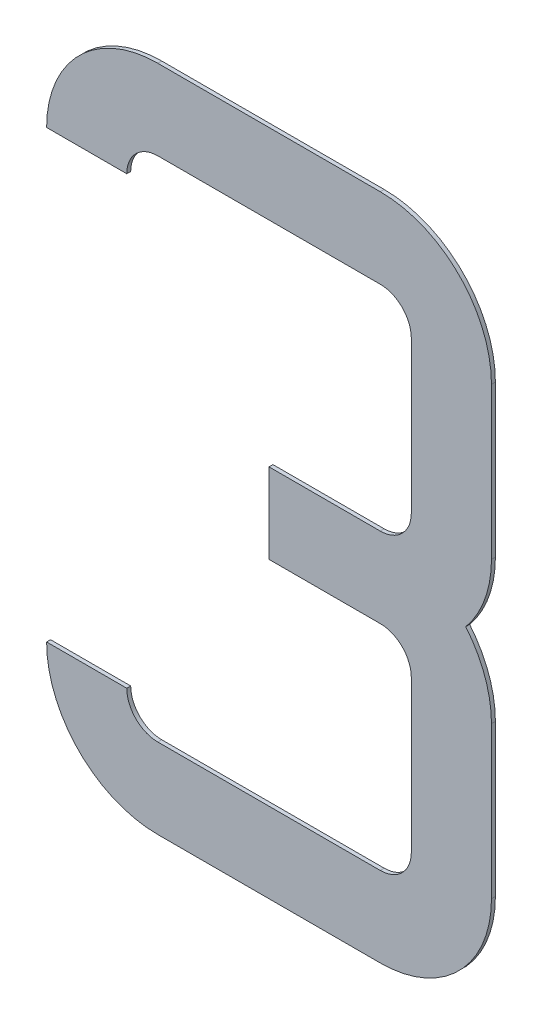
ISO-10303-21;
HEADER;
FILE_DESCRIPTION(('STEP AP214'),'2;1');
FILE_NAME('part.step','',(''),(''),'','','');
FILE_SCHEMA(('AUTOMOTIVE_DESIGN { 1 0 10303 214 1 1 1 1 }'));
ENDSEC;
DATA;
#1=APPLICATION_CONTEXT('core data for automotive mechanical design processes');
#2=APPLICATION_PROTOCOL_DEFINITION('international standard','automotive_design',2000,#1);
#3=PRODUCT_CONTEXT('',#1,'mechanical');
#4=PRODUCT('Part','Part','',(#3));
#5=PRODUCT_RELATED_PRODUCT_CATEGORY('part','',(#4));
#6=PRODUCT_DEFINITION_FORMATION('','',#4);
#7=PRODUCT_DEFINITION_CONTEXT('part definition',#1,'design');
#8=PRODUCT_DEFINITION('design','',#6,#7);
#9=PRODUCT_DEFINITION_SHAPE('','',#8);
#10=(LENGTH_UNIT() NAMED_UNIT(*) SI_UNIT(.MILLI.,.METRE.));
#11=(NAMED_UNIT(*) PLANE_ANGLE_UNIT() SI_UNIT($,.RADIAN.));
#12=(NAMED_UNIT(*) SI_UNIT($,.STERADIAN.) SOLID_ANGLE_UNIT());
#13=UNCERTAINTY_MEASURE_WITH_UNIT(LENGTH_MEASURE(1.E-05),#10,'distance_accuracy_value','');
#14=(GEOMETRIC_REPRESENTATION_CONTEXT(3) GLOBAL_UNCERTAINTY_ASSIGNED_CONTEXT((#13)) GLOBAL_UNIT_ASSIGNED_CONTEXT((#10,
#11,#12)) REPRESENTATION_CONTEXT('',''));
#15=CARTESIAN_POINT('',(0.,0.,0.));
#16=DIRECTION('',(0.,0.,1.));
#17=DIRECTION('',(1.,0.,0.));
#18=AXIS2_PLACEMENT_3D('',#15,#16,#17);
#19=CARTESIAN_POINT('',(2.8305,10.3105,0.1));
#20=DIRECTION('',(0.,0.,-1.));
#21=DIRECTION('',(-1.,0.,0.));
#22=AXIS2_PLACEMENT_3D('',#19,#20,#21);
#23=CYLINDRICAL_SURFACE('',#22,2.8305);
#24=CARTESIAN_POINT('',(2.8305,10.3105,0.));
#25=DIRECTION('',(0.,0.,1.));
#26=DIRECTION('',(1.,0.,0.));
#27=AXIS2_PLACEMENT_3D('',#24,#25,#26);
#28=CIRCLE('',#27,2.8305);
#29=CARTESIAN_POINT('',(5.00623435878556,8.5,0.));
#30=VERTEX_POINT('',#29);
#31=CARTESIAN_POINT('',(5.661,10.3105,0.));
#32=VERTEX_POINT('',#31);
#33=EDGE_CURVE('E260',#30,#32,#28,.T.);
#34=ORIENTED_EDGE('',*,*,#33,.T.);
#35=DIRECTION('',(0.,0.,-1.));
#36=VECTOR('',#35,1.);
#37=CARTESIAN_POINT('',(5.661,10.3105,0.1));
#38=LINE('',#37,#36);
#39=CARTESIAN_POINT('',(5.661,10.3105,0.1));
#40=VERTEX_POINT('',#39);
#41=EDGE_CURVE('E9',#40,#32,#38,.T.);
#42=ORIENTED_EDGE('',*,*,#41,.F.);
#43=CARTESIAN_POINT('',(2.8305,10.3105,0.1));
#44=DIRECTION('',(0.,0.,1.));
#45=DIRECTION('',(1.,0.,0.));
#46=AXIS2_PLACEMENT_3D('',#43,#44,#45);
#47=CIRCLE('',#46,2.8305);
#48=CARTESIAN_POINT('',(5.00623435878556,8.5,0.1));
#49=VERTEX_POINT('',#48);
#50=EDGE_CURVE('E262',#49,#40,#47,.T.);
#51=ORIENTED_EDGE('',*,*,#50,.F.);
#52=DIRECTION('',(0.,0.,-1.));
#53=VECTOR('',#52,1.);
#54=CARTESIAN_POINT('',(5.00623435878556,8.5,0.1));
#55=LINE('',#54,#53);
#56=EDGE_CURVE('E256',#49,#30,#55,.T.);
#57=ORIENTED_EDGE('',*,*,#56,.T.);
#58=EDGE_LOOP('',(#34,#42,#51,#57));
#59=FACE_BOUND('',#58,.T.);
#60=ADVANCED_FACE('F14',(#59),#23,.T.);
#61=CARTESIAN_POINT('',(5.661,10.3105,0.1));
#62=DIRECTION('',(-1.,0.,0.));
#63=DIRECTION('',(0.,0.,1.));
#64=AXIS2_PLACEMENT_3D('',#61,#62,#63);
#65=PLANE('',#64);
#66=DIRECTION('',(0.,1.,0.));
#67=VECTOR('',#66,1.);
#68=CARTESIAN_POINT('',(5.661,10.3105,0.));
#69=LINE('',#68,#67);
#70=CARTESIAN_POINT('',(5.661,14.1695,0.));
#71=VERTEX_POINT('',#70);
#72=EDGE_CURVE('E347',#32,#71,#69,.T.);
#73=ORIENTED_EDGE('',*,*,#72,.T.);
#74=DIRECTION('',(0.,0.,-1.));
#75=VECTOR('',#74,1.);
#76=CARTESIAN_POINT('',(5.661,14.1695,0.1));
#77=LINE('',#76,#75);
#78=CARTESIAN_POINT('',(5.661,14.1695,0.1));
#79=VERTEX_POINT('',#78);
#80=EDGE_CURVE('E23',#79,#71,#77,.T.);
#81=ORIENTED_EDGE('',*,*,#80,.F.);
#82=DIRECTION('',(0.,1.,0.));
#83=VECTOR('',#82,1.);
#84=CARTESIAN_POINT('',(5.661,10.3105,0.1));
#85=LINE('',#84,#83);
#86=EDGE_CURVE('E35',#40,#79,#85,.T.);
#87=ORIENTED_EDGE('',*,*,#86,.F.);
#88=ORIENTED_EDGE('',*,*,#41,.T.);
#89=EDGE_LOOP('',(#73,#81,#87,#88));
#90=FACE_BOUND('',#89,.T.);
#91=ADVANCED_FACE('F599',(#90),#65,.F.);
#92=CARTESIAN_POINT('',(2.8305,14.1695,0.1));
#93=DIRECTION('',(0.,0.,-1.));
#94=DIRECTION('',(-1.,0.,0.));
#95=AXIS2_PLACEMENT_3D('',#92,#93,#94);
#96=CYLINDRICAL_SURFACE('',#95,2.8305);
#97=CARTESIAN_POINT('',(2.8305,14.1695,0.));
#98=DIRECTION('',(0.,0.,1.));
#99=DIRECTION('',(1.,0.,0.));
#100=AXIS2_PLACEMENT_3D('',#97,#98,#99);
#101=CIRCLE('',#100,2.8305);
#102=CARTESIAN_POINT('',(2.8305,17.,0.));
#103=VERTEX_POINT('',#102);
#104=EDGE_CURVE('E344',#71,#103,#101,.T.);
#105=ORIENTED_EDGE('',*,*,#104,.T.);
#106=DIRECTION('',(0.,0.,-1.));
#107=VECTOR('',#106,1.);
#108=CARTESIAN_POINT('',(2.8305,17.,0.1));
#109=LINE('',#108,#107);
#110=CARTESIAN_POINT('',(2.8305,17.,0.1));
#111=VERTEX_POINT('',#110);
#112=EDGE_CURVE('E436',#111,#103,#109,.T.);
#113=ORIENTED_EDGE('',*,*,#112,.F.);
#114=CARTESIAN_POINT('',(2.8305,14.1695,0.1));
#115=DIRECTION('',(0.,0.,1.));
#116=DIRECTION('',(1.,0.,0.));
#117=AXIS2_PLACEMENT_3D('',#114,#115,#116);
#118=CIRCLE('',#117,2.8305);
#119=EDGE_CURVE('E429',#79,#111,#118,.T.);
#120=ORIENTED_EDGE('',*,*,#119,.F.);
#121=ORIENTED_EDGE('',*,*,#80,.T.);
#122=EDGE_LOOP('',(#105,#113,#120,#121));
#123=FACE_BOUND('',#122,.T.);
#124=ADVANCED_FACE('F597',(#123),#96,.T.);
#125=CARTESIAN_POINT('',(2.8305,17.,0.1));
#126=DIRECTION('',(0.,-1.,0.));
#127=DIRECTION('',(0.,0.,-1.));
#128=AXIS2_PLACEMENT_3D('',#125,#126,#127);
#129=PLANE('',#128);
#130=DIRECTION('',(-1.,0.,0.));
#131=VECTOR('',#130,1.);
#132=CARTESIAN_POINT('',(2.8305,17.,0.));
#133=LINE('',#132,#131);
#134=CARTESIAN_POINT('',(-2.8305,17.,0.));
#135=VERTEX_POINT('',#134);
#136=EDGE_CURVE('E341',#103,#135,#133,.T.);
#137=ORIENTED_EDGE('',*,*,#136,.T.);
#138=DIRECTION('',(0.,0.,-1.));
#139=VECTOR('',#138,1.);
#140=CARTESIAN_POINT('',(-2.8305,17.,0.1));
#141=LINE('',#140,#139);
#142=CARTESIAN_POINT('',(-2.8305,17.,0.1));
#143=VERTEX_POINT('',#142);
#144=EDGE_CURVE('E440',#143,#135,#141,.T.);
#145=ORIENTED_EDGE('',*,*,#144,.F.);
#146=DIRECTION('',(-1.,0.,0.));
#147=VECTOR('',#146,1.);
#148=CARTESIAN_POINT('',(2.8305,17.,0.1));
#149=LINE('',#148,#147);
#150=EDGE_CURVE('E426',#111,#143,#149,.T.);
#151=ORIENTED_EDGE('',*,*,#150,.F.);
#152=ORIENTED_EDGE('',*,*,#112,.T.);
#153=EDGE_LOOP('',(#137,#145,#151,#152));
#154=FACE_BOUND('',#153,.T.);
#155=ADVANCED_FACE('F593',(#154),#129,.F.);
#156=CARTESIAN_POINT('',(-2.8305,14.1695,0.1));
#157=DIRECTION('',(0.,0.,-1.));
#158=DIRECTION('',(-1.,0.,0.));
#159=AXIS2_PLACEMENT_3D('',#156,#157,#158);
#160=CYLINDRICAL_SURFACE('',#159,2.8305);
#161=CARTESIAN_POINT('',(-2.8305,14.1695,0.));
#162=DIRECTION('',(0.,0.,1.));
#163=DIRECTION('',(1.,0.,0.));
#164=AXIS2_PLACEMENT_3D('',#161,#162,#163);
#165=CIRCLE('',#164,2.8305);
#166=CARTESIAN_POINT('',(-5.661,14.1695,0.));
#167=VERTEX_POINT('',#166);
#168=EDGE_CURVE('E337',#135,#167,#165,.T.);
#169=ORIENTED_EDGE('',*,*,#168,.T.);
#170=DIRECTION('',(0.,0.,-1.));
#171=VECTOR('',#170,1.);
#172=CARTESIAN_POINT('',(-5.661,14.1695,0.1));
#173=LINE('',#172,#171);
#174=CARTESIAN_POINT('',(-5.661,14.1695,0.1));
#175=VERTEX_POINT('',#174);
#176=EDGE_CURVE('E444',#175,#167,#173,.T.);
#177=ORIENTED_EDGE('',*,*,#176,.F.);
#178=CARTESIAN_POINT('',(-2.8305,14.1695,0.1));
#179=DIRECTION('',(0.,0.,1.));
#180=DIRECTION('',(1.,0.,0.));
#181=AXIS2_PLACEMENT_3D('',#178,#179,#180);
#182=CIRCLE('',#181,2.8305);
#183=EDGE_CURVE('E423',#143,#175,#182,.T.);
#184=ORIENTED_EDGE('',*,*,#183,.F.);
#185=ORIENTED_EDGE('',*,*,#144,.T.);
#186=EDGE_LOOP('',(#169,#177,#184,#185));
#187=FACE_BOUND('',#186,.T.);
#188=ADVANCED_FACE('F589',(#187),#160,.T.);
#189=CARTESIAN_POINT('',(-3.621,14.1695,0.1));
#190=DIRECTION('',(0.,-1.,0.));
#191=DIRECTION('',(0.,0.,-1.));
#192=AXIS2_PLACEMENT_3D('',#189,#190,#191);
#193=PLANE('',#192);
#194=DIRECTION('',(-1.,0.,0.));
#195=VECTOR('',#194,1.);
#196=CARTESIAN_POINT('',(-3.621,14.1695,0.));
#197=LINE('',#196,#195);
#198=CARTESIAN_POINT('',(-3.621,14.1695,0.));
#199=VERTEX_POINT('',#198);
#200=EDGE_CURVE('E333',#199,#167,#197,.T.);
#201=ORIENTED_EDGE('',*,*,#200,.F.);
#202=DIRECTION('',(0.,0.,-1.));
#203=VECTOR('',#202,1.);
#204=CARTESIAN_POINT('',(-3.621,14.1695,0.1));
#205=LINE('',#204,#203);
#206=CARTESIAN_POINT('',(-3.621,14.1695,0.1));
#207=VERTEX_POINT('',#206);
#208=EDGE_CURVE('E447',#207,#199,#205,.T.);
#209=ORIENTED_EDGE('',*,*,#208,.F.);
#210=DIRECTION('',(-1.,0.,0.));
#211=VECTOR('',#210,1.);
#212=CARTESIAN_POINT('',(-3.621,14.1695,0.1));
#213=LINE('',#212,#211);
#214=EDGE_CURVE('E419',#207,#175,#213,.T.);
#215=ORIENTED_EDGE('',*,*,#214,.T.);
#216=ORIENTED_EDGE('',*,*,#176,.T.);
#217=EDGE_LOOP('',(#201,#209,#215,#216));
#218=FACE_BOUND('',#217,.T.);
#219=ADVANCED_FACE('F584',(#218),#193,.T.);
#220=CARTESIAN_POINT('',(-2.8305,14.1695,0.1));
#221=DIRECTION('',(0.,0.,-1.));
#222=DIRECTION('',(-1.,0.,0.));
#223=AXIS2_PLACEMENT_3D('',#220,#221,#222);
#224=CYLINDRICAL_SURFACE('',#223,0.7905);
#225=CARTESIAN_POINT('',(-2.8305,14.1695,0.));
#226=DIRECTION('',(0.,0.,1.));
#227=DIRECTION('',(1.,0.,0.));
#228=AXIS2_PLACEMENT_3D('',#225,#226,#227);
#229=CIRCLE('',#228,0.7905);
#230=CARTESIAN_POINT('',(-2.8305,14.96,0.));
#231=VERTEX_POINT('',#230);
#232=EDGE_CURVE('E329',#231,#199,#229,.T.);
#233=ORIENTED_EDGE('',*,*,#232,.F.);
#234=DIRECTION('',(0.,0.,-1.));
#235=VECTOR('',#234,1.);
#236=CARTESIAN_POINT('',(-2.8305,14.96,0.1));
#237=LINE('',#236,#235);
#238=CARTESIAN_POINT('',(-2.8305,14.96,0.1));
#239=VERTEX_POINT('',#238);
#240=EDGE_CURVE('E450',#239,#231,#237,.T.);
#241=ORIENTED_EDGE('',*,*,#240,.F.);
#242=CARTESIAN_POINT('',(-2.8305,14.1695,0.1));
#243=DIRECTION('',(0.,0.,1.));
#244=DIRECTION('',(1.,0.,0.));
#245=AXIS2_PLACEMENT_3D('',#242,#243,#244);
#246=CIRCLE('',#245,0.7905);
#247=EDGE_CURVE('E415',#239,#207,#246,.T.);
#248=ORIENTED_EDGE('',*,*,#247,.T.);
#249=ORIENTED_EDGE('',*,*,#208,.T.);
#250=EDGE_LOOP('',(#233,#241,#248,#249));
#251=FACE_BOUND('',#250,.T.);
#252=ADVANCED_FACE('F579',(#251),#224,.F.);
#253=CARTESIAN_POINT('',(2.8305,14.96,0.1));
#254=DIRECTION('',(0.,-1.,0.));
#255=DIRECTION('',(0.,0.,-1.));
#256=AXIS2_PLACEMENT_3D('',#253,#254,#255);
#257=PLANE('',#256);
#258=DIRECTION('',(-1.,0.,0.));
#259=VECTOR('',#258,1.);
#260=CARTESIAN_POINT('',(2.8305,14.96,0.));
#261=LINE('',#260,#259);
#262=CARTESIAN_POINT('',(2.8305,14.96,0.));
#263=VERTEX_POINT('',#262);
#264=EDGE_CURVE('E325',#263,#231,#261,.T.);
#265=ORIENTED_EDGE('',*,*,#264,.F.);
#266=DIRECTION('',(0.,0.,-1.));
#267=VECTOR('',#266,1.);
#268=CARTESIAN_POINT('',(2.8305,14.96,0.1));
#269=LINE('',#268,#267);
#270=CARTESIAN_POINT('',(2.8305,14.96,0.1));
#271=VERTEX_POINT('',#270);
#272=EDGE_CURVE('E453',#271,#263,#269,.T.);
#273=ORIENTED_EDGE('',*,*,#272,.F.);
#274=DIRECTION('',(-1.,0.,0.));
#275=VECTOR('',#274,1.);
#276=CARTESIAN_POINT('',(2.8305,14.96,0.1));
#277=LINE('',#276,#275);
#278=EDGE_CURVE('E411',#271,#239,#277,.T.);
#279=ORIENTED_EDGE('',*,*,#278,.T.);
#280=ORIENTED_EDGE('',*,*,#240,.T.);
#281=EDGE_LOOP('',(#265,#273,#279,#280));
#282=FACE_BOUND('',#281,.T.);
#283=ADVANCED_FACE('F575',(#282),#257,.T.);
#284=CARTESIAN_POINT('',(2.8305,14.1695,0.1));
#285=DIRECTION('',(0.,0.,-1.));
#286=DIRECTION('',(-1.,0.,0.));
#287=AXIS2_PLACEMENT_3D('',#284,#285,#286);
#288=CYLINDRICAL_SURFACE('',#287,0.7905);
#289=CARTESIAN_POINT('',(2.8305,14.1695,0.));
#290=DIRECTION('',(0.,0.,1.));
#291=DIRECTION('',(1.,0.,0.));
#292=AXIS2_PLACEMENT_3D('',#289,#290,#291);
#293=CIRCLE('',#292,0.7905);
#294=CARTESIAN_POINT('',(3.621,14.1695,0.));
#295=VERTEX_POINT('',#294);
#296=EDGE_CURVE('E321',#295,#263,#293,.T.);
#297=ORIENTED_EDGE('',*,*,#296,.F.);
#298=DIRECTION('',(0.,0.,-1.));
#299=VECTOR('',#298,1.);
#300=CARTESIAN_POINT('',(3.621,14.1695,0.1));
#301=LINE('',#300,#299);
#302=CARTESIAN_POINT('',(3.621,14.1695,0.1));
#303=VERTEX_POINT('',#302);
#304=EDGE_CURVE('E456',#303,#295,#301,.T.);
#305=ORIENTED_EDGE('',*,*,#304,.F.);
#306=CARTESIAN_POINT('',(2.8305,14.1695,0.1));
#307=DIRECTION('',(0.,0.,1.));
#308=DIRECTION('',(1.,0.,0.));
#309=AXIS2_PLACEMENT_3D('',#306,#307,#308);
#310=CIRCLE('',#309,0.7905);
#311=EDGE_CURVE('E407',#303,#271,#310,.T.);
#312=ORIENTED_EDGE('',*,*,#311,.T.);
#313=ORIENTED_EDGE('',*,*,#272,.T.);
#314=EDGE_LOOP('',(#297,#305,#312,#313));
#315=FACE_BOUND('',#314,.T.);
#316=ADVANCED_FACE('F571',(#315),#288,.F.);
#317=CARTESIAN_POINT('',(3.621,10.3105,0.1));
#318=DIRECTION('',(-1.,0.,0.));
#319=DIRECTION('',(0.,-1.,0.));
#320=AXIS2_PLACEMENT_3D('',#317,#318,#319);
#321=PLANE('',#320);
#322=DIRECTION('',(0.,1.,0.));
#323=VECTOR('',#322,1.);
#324=CARTESIAN_POINT('',(3.621,10.3105,0.));
#325=LINE('',#324,#323);
#326=CARTESIAN_POINT('',(3.621,10.3105,0.));
#327=VERTEX_POINT('',#326);
#328=EDGE_CURVE('E317',#327,#295,#325,.T.);
#329=ORIENTED_EDGE('',*,*,#328,.F.);
#330=DIRECTION('',(0.,0.,-1.));
#331=VECTOR('',#330,1.);
#332=CARTESIAN_POINT('',(3.621,10.3105,0.1));
#333=LINE('',#332,#331);
#334=CARTESIAN_POINT('',(3.621,10.3105,0.1));
#335=VERTEX_POINT('',#334);
#336=EDGE_CURVE('E459',#335,#327,#333,.T.);
#337=ORIENTED_EDGE('',*,*,#336,.F.);
#338=DIRECTION('',(0.,1.,0.));
#339=VECTOR('',#338,1.);
#340=CARTESIAN_POINT('',(3.621,10.3105,0.1));
#341=LINE('',#340,#339);
#342=EDGE_CURVE('E403',#335,#303,#341,.T.);
#343=ORIENTED_EDGE('',*,*,#342,.T.);
#344=ORIENTED_EDGE('',*,*,#304,.T.);
#345=EDGE_LOOP('',(#329,#337,#343,#344));
#346=FACE_BOUND('',#345,.T.);
#347=ADVANCED_FACE('F567',(#346),#321,.T.);
#348=CARTESIAN_POINT('',(2.8305,10.3105,0.1));
#349=DIRECTION('',(0.,0.,-1.));
#350=DIRECTION('',(-1.,0.,0.));
#351=AXIS2_PLACEMENT_3D('',#348,#349,#350);
#352=CYLINDRICAL_SURFACE('',#351,0.7905);
#353=CARTESIAN_POINT('',(2.8305,10.3105,0.));
#354=DIRECTION('',(0.,0.,1.));
#355=DIRECTION('',(1.,0.,0.));
#356=AXIS2_PLACEMENT_3D('',#353,#354,#355);
#357=CIRCLE('',#356,0.7905);
#358=CARTESIAN_POINT('',(2.8305,9.52,0.));
#359=VERTEX_POINT('',#358);
#360=EDGE_CURVE('E313',#359,#327,#357,.T.);
#361=ORIENTED_EDGE('',*,*,#360,.F.);
#362=DIRECTION('',(0.,0.,-1.));
#363=VECTOR('',#362,1.);
#364=CARTESIAN_POINT('',(2.8305,9.52,0.1));
#365=LINE('',#364,#363);
#366=CARTESIAN_POINT('',(2.8305,9.52,0.1));
#367=VERTEX_POINT('',#366);
#368=EDGE_CURVE('E462',#367,#359,#365,.T.);
#369=ORIENTED_EDGE('',*,*,#368,.F.);
#370=CARTESIAN_POINT('',(2.8305,10.3105,0.1));
#371=DIRECTION('',(0.,0.,1.));
#372=DIRECTION('',(1.,0.,0.));
#373=AXIS2_PLACEMENT_3D('',#370,#371,#372);
#374=CIRCLE('',#373,0.7905);
#375=EDGE_CURVE('E399',#367,#335,#374,.T.);
#376=ORIENTED_EDGE('',*,*,#375,.T.);
#377=ORIENTED_EDGE('',*,*,#336,.T.);
#378=EDGE_LOOP('',(#361,#369,#376,#377));
#379=FACE_BOUND('',#378,.T.);
#380=ADVANCED_FACE('F562',(#379),#352,.F.);
#381=CARTESIAN_POINT('',(2.8305,9.52,0.1));
#382=DIRECTION('',(0.,-1.,0.));
#383=DIRECTION('',(0.,0.,-1.));
#384=AXIS2_PLACEMENT_3D('',#381,#382,#383);
#385=PLANE('',#384);
#386=DIRECTION('',(-1.,0.,0.));
#387=VECTOR('',#386,1.);
#388=CARTESIAN_POINT('',(2.8305,9.52,0.));
#389=LINE('',#388,#387);
#390=CARTESIAN_POINT('',(0.,9.52,0.));
#391=VERTEX_POINT('',#390);
#392=EDGE_CURVE('E309',#359,#391,#389,.T.);
#393=ORIENTED_EDGE('',*,*,#392,.T.);
#394=DIRECTION('',(0.,0.,-1.));
#395=VECTOR('',#394,1.);
#396=CARTESIAN_POINT('',(0.,9.52,0.1));
#397=LINE('',#396,#395);
#398=CARTESIAN_POINT('',(0.,9.52,0.1));
#399=VERTEX_POINT('',#398);
#400=EDGE_CURVE('E465',#399,#391,#397,.T.);
#401=ORIENTED_EDGE('',*,*,#400,.F.);
#402=DIRECTION('',(-1.,0.,0.));
#403=VECTOR('',#402,1.);
#404=CARTESIAN_POINT('',(2.8305,9.52,0.1));
#405=LINE('',#404,#403);
#406=EDGE_CURVE('E396',#367,#399,#405,.T.);
#407=ORIENTED_EDGE('',*,*,#406,.F.);
#408=ORIENTED_EDGE('',*,*,#368,.T.);
#409=EDGE_LOOP('',(#393,#401,#407,#408));
#410=FACE_BOUND('',#409,.T.);
#411=ADVANCED_FACE('F559',(#410),#385,.F.);
#412=CARTESIAN_POINT('',(0.,7.48,0.1));
#413=DIRECTION('',(-1.,0.,0.));
#414=DIRECTION('',(0.,-1.,0.));
#415=AXIS2_PLACEMENT_3D('',#412,#413,#414);
#416=PLANE('',#415);
#417=DIRECTION('',(0.,1.,0.));
#418=VECTOR('',#417,1.);
#419=CARTESIAN_POINT('',(0.,7.48,0.));
#420=LINE('',#419,#418);
#421=CARTESIAN_POINT('',(0.,7.48,0.));
#422=VERTEX_POINT('',#421);
#423=EDGE_CURVE('E305',#422,#391,#420,.T.);
#424=ORIENTED_EDGE('',*,*,#423,.F.);
#425=DIRECTION('',(0.,0.,-1.));
#426=VECTOR('',#425,1.);
#427=CARTESIAN_POINT('',(0.,7.48,0.1));
#428=LINE('',#427,#426);
#429=CARTESIAN_POINT('',(0.,7.48,0.1));
#430=VERTEX_POINT('',#429);
#431=EDGE_CURVE('E468',#430,#422,#428,.T.);
#432=ORIENTED_EDGE('',*,*,#431,.F.);
#433=DIRECTION('',(0.,1.,0.));
#434=VECTOR('',#433,1.);
#435=CARTESIAN_POINT('',(0.,7.48,0.1));
#436=LINE('',#435,#434);
#437=EDGE_CURVE('E392',#430,#399,#436,.T.);
#438=ORIENTED_EDGE('',*,*,#437,.T.);
#439=ORIENTED_EDGE('',*,*,#400,.T.);
#440=EDGE_LOOP('',(#424,#432,#438,#439));
#441=FACE_BOUND('',#440,.T.);
#442=ADVANCED_FACE('F555',(#441),#416,.T.);
#443=CARTESIAN_POINT('',(2.8305,7.48,0.1));
#444=DIRECTION('',(0.,-1.,0.));
#445=DIRECTION('',(0.,0.,-1.));
#446=AXIS2_PLACEMENT_3D('',#443,#444,#445);
#447=PLANE('',#446);
#448=DIRECTION('',(-1.,0.,0.));
#449=VECTOR('',#448,1.);
#450=CARTESIAN_POINT('',(2.8305,7.48,0.));
#451=LINE('',#450,#449);
#452=CARTESIAN_POINT('',(2.8305,7.48,0.));
#453=VERTEX_POINT('',#452);
#454=EDGE_CURVE('E301',#453,#422,#451,.T.);
#455=ORIENTED_EDGE('',*,*,#454,.F.);
#456=DIRECTION('',(0.,0.,-1.));
#457=VECTOR('',#456,1.);
#458=CARTESIAN_POINT('',(2.8305,7.48,0.1));
#459=LINE('',#458,#457);
#460=CARTESIAN_POINT('',(2.8305,7.48,0.1));
#461=VERTEX_POINT('',#460);
#462=EDGE_CURVE('E471',#461,#453,#459,.T.);
#463=ORIENTED_EDGE('',*,*,#462,.F.);
#464=DIRECTION('',(-1.,0.,0.));
#465=VECTOR('',#464,1.);
#466=CARTESIAN_POINT('',(2.8305,7.48,0.1));
#467=LINE('',#466,#465);
#468=EDGE_CURVE('E388',#461,#430,#467,.T.);
#469=ORIENTED_EDGE('',*,*,#468,.T.);
#470=ORIENTED_EDGE('',*,*,#431,.T.);
#471=EDGE_LOOP('',(#455,#463,#469,#470));
#472=FACE_BOUND('',#471,.T.);
#473=ADVANCED_FACE('F551',(#472),#447,.T.);
#474=CARTESIAN_POINT('',(2.8305,6.6895,0.1));
#475=DIRECTION('',(0.,0.,-1.));
#476=DIRECTION('',(-1.,0.,0.));
#477=AXIS2_PLACEMENT_3D('',#474,#475,#476);
#478=CYLINDRICAL_SURFACE('',#477,0.7905);
#479=CARTESIAN_POINT('',(2.8305,6.6895,0.));
#480=DIRECTION('',(0.,0.,1.));
#481=DIRECTION('',(1.,0.,0.));
#482=AXIS2_PLACEMENT_3D('',#479,#480,#481);
#483=CIRCLE('',#482,0.7905);
#484=CARTESIAN_POINT('',(3.621,6.6895,0.));
#485=VERTEX_POINT('',#484);
#486=EDGE_CURVE('E297',#485,#453,#483,.T.);
#487=ORIENTED_EDGE('',*,*,#486,.F.);
#488=DIRECTION('',(0.,0.,-1.));
#489=VECTOR('',#488,1.);
#490=CARTESIAN_POINT('',(3.621,6.6895,0.1));
#491=LINE('',#490,#489);
#492=CARTESIAN_POINT('',(3.621,6.6895,0.1));
#493=VERTEX_POINT('',#492);
#494=EDGE_CURVE('E474',#493,#485,#491,.T.);
#495=ORIENTED_EDGE('',*,*,#494,.F.);
#496=CARTESIAN_POINT('',(2.8305,6.6895,0.1));
#497=DIRECTION('',(0.,0.,1.));
#498=DIRECTION('',(1.,0.,0.));
#499=AXIS2_PLACEMENT_3D('',#496,#497,#498);
#500=CIRCLE('',#499,0.7905);
#501=EDGE_CURVE('E384',#493,#461,#500,.T.);
#502=ORIENTED_EDGE('',*,*,#501,.T.);
#503=ORIENTED_EDGE('',*,*,#462,.T.);
#504=EDGE_LOOP('',(#487,#495,#502,#503));
#505=FACE_BOUND('',#504,.T.);
#506=ADVANCED_FACE('F546',(#505),#478,.F.);
#507=CARTESIAN_POINT('',(3.621,2.8305,0.1));
#508=DIRECTION('',(-1.,0.,0.));
#509=DIRECTION('',(0.,-1.,0.));
#510=AXIS2_PLACEMENT_3D('',#507,#508,#509);
#511=PLANE('',#510);
#512=DIRECTION('',(0.,1.,0.));
#513=VECTOR('',#512,1.);
#514=CARTESIAN_POINT('',(3.621,2.8305,0.));
#515=LINE('',#514,#513);
#516=CARTESIAN_POINT('',(3.621,2.8305,0.));
#517=VERTEX_POINT('',#516);
#518=EDGE_CURVE('E293',#517,#485,#515,.T.);
#519=ORIENTED_EDGE('',*,*,#518,.F.);
#520=DIRECTION('',(0.,0.,-1.));
#521=VECTOR('',#520,1.);
#522=CARTESIAN_POINT('',(3.621,2.8305,0.1));
#523=LINE('',#522,#521);
#524=CARTESIAN_POINT('',(3.621,2.8305,0.1));
#525=VERTEX_POINT('',#524);
#526=EDGE_CURVE('E477',#525,#517,#523,.T.);
#527=ORIENTED_EDGE('',*,*,#526,.F.);
#528=DIRECTION('',(0.,1.,0.));
#529=VECTOR('',#528,1.);
#530=CARTESIAN_POINT('',(3.621,2.8305,0.1));
#531=LINE('',#530,#529);
#532=EDGE_CURVE('E380',#525,#493,#531,.T.);
#533=ORIENTED_EDGE('',*,*,#532,.T.);
#534=ORIENTED_EDGE('',*,*,#494,.T.);
#535=EDGE_LOOP('',(#519,#527,#533,#534));
#536=FACE_BOUND('',#535,.T.);
#537=ADVANCED_FACE('F542',(#536),#511,.T.);
#538=CARTESIAN_POINT('',(2.8305,2.8305,0.1));
#539=DIRECTION('',(0.,0.,-1.));
#540=DIRECTION('',(-1.,0.,0.));
#541=AXIS2_PLACEMENT_3D('',#538,#539,#540);
#542=CYLINDRICAL_SURFACE('',#541,0.7905);
#543=CARTESIAN_POINT('',(2.8305,2.8305,0.));
#544=DIRECTION('',(0.,0.,1.));
#545=DIRECTION('',(1.,0.,0.));
#546=AXIS2_PLACEMENT_3D('',#543,#544,#545);
#547=CIRCLE('',#546,0.7905);
#548=CARTESIAN_POINT('',(2.8305,2.04,0.));
#549=VERTEX_POINT('',#548);
#550=EDGE_CURVE('E289',#549,#517,#547,.T.);
#551=ORIENTED_EDGE('',*,*,#550,.F.);
#552=DIRECTION('',(0.,0.,-1.));
#553=VECTOR('',#552,1.);
#554=CARTESIAN_POINT('',(2.8305,2.04,0.1));
#555=LINE('',#554,#553);
#556=CARTESIAN_POINT('',(2.8305,2.04,0.1));
#557=VERTEX_POINT('',#556);
#558=EDGE_CURVE('E480',#557,#549,#555,.T.);
#559=ORIENTED_EDGE('',*,*,#558,.F.);
#560=CARTESIAN_POINT('',(2.8305,2.8305,0.1));
#561=DIRECTION('',(0.,0.,1.));
#562=DIRECTION('',(1.,0.,0.));
#563=AXIS2_PLACEMENT_3D('',#560,#561,#562);
#564=CIRCLE('',#563,0.7905);
#565=EDGE_CURVE('E376',#557,#525,#564,.T.);
#566=ORIENTED_EDGE('',*,*,#565,.T.);
#567=ORIENTED_EDGE('',*,*,#526,.T.);
#568=EDGE_LOOP('',(#551,#559,#566,#567));
#569=FACE_BOUND('',#568,.T.);
#570=ADVANCED_FACE('F538',(#569),#542,.F.);
#571=CARTESIAN_POINT('',(-2.8305,2.04,0.1));
#572=DIRECTION('',(0.,1.,0.));
#573=DIRECTION('',(0.,0.,1.));
#574=AXIS2_PLACEMENT_3D('',#571,#572,#573);
#575=PLANE('',#574);
#576=DIRECTION('',(1.,0.,0.));
#577=VECTOR('',#576,1.);
#578=CARTESIAN_POINT('',(-2.8305,2.04,0.));
#579=LINE('',#578,#577);
#580=CARTESIAN_POINT('',(-2.8305,2.04,0.));
#581=VERTEX_POINT('',#580);
#582=EDGE_CURVE('E285',#581,#549,#579,.T.);
#583=ORIENTED_EDGE('',*,*,#582,.F.);
#584=DIRECTION('',(0.,0.,-1.));
#585=VECTOR('',#584,1.);
#586=CARTESIAN_POINT('',(-2.8305,2.04,0.1));
#587=LINE('',#586,#585);
#588=CARTESIAN_POINT('',(-2.8305,2.04,0.1));
#589=VERTEX_POINT('',#588);
#590=EDGE_CURVE('E483',#589,#581,#587,.T.);
#591=ORIENTED_EDGE('',*,*,#590,.F.);
#592=DIRECTION('',(1.,0.,0.));
#593=VECTOR('',#592,1.);
#594=CARTESIAN_POINT('',(-2.8305,2.04,0.1));
#595=LINE('',#594,#593);
#596=EDGE_CURVE('E372',#589,#557,#595,.T.);
#597=ORIENTED_EDGE('',*,*,#596,.T.);
#598=ORIENTED_EDGE('',*,*,#558,.T.);
#599=EDGE_LOOP('',(#583,#591,#597,#598));
#600=FACE_BOUND('',#599,.T.);
#601=ADVANCED_FACE('F534',(#600),#575,.T.);
#602=CARTESIAN_POINT('',(-2.8305,2.8305,0.1));
#603=DIRECTION('',(0.,0.,-1.));
#604=DIRECTION('',(-1.,0.,0.));
#605=AXIS2_PLACEMENT_3D('',#602,#603,#604);
#606=CYLINDRICAL_SURFACE('',#605,0.7905);
#607=CARTESIAN_POINT('',(-2.8305,2.8305,0.));
#608=DIRECTION('',(0.,0.,1.));
#609=DIRECTION('',(1.,0.,0.));
#610=AXIS2_PLACEMENT_3D('',#607,#608,#609);
#611=CIRCLE('',#610,0.7905);
#612=CARTESIAN_POINT('',(-3.621,2.8305,0.));
#613=VERTEX_POINT('',#612);
#614=EDGE_CURVE('E281',#613,#581,#611,.T.);
#615=ORIENTED_EDGE('',*,*,#614,.F.);
#616=DIRECTION('',(0.,0.,-1.));
#617=VECTOR('',#616,1.);
#618=CARTESIAN_POINT('',(-3.621,2.8305,0.1));
#619=LINE('',#618,#617);
#620=CARTESIAN_POINT('',(-3.621,2.8305,0.1));
#621=VERTEX_POINT('',#620);
#622=EDGE_CURVE('E486',#621,#613,#619,.T.);
#623=ORIENTED_EDGE('',*,*,#622,.F.);
#624=CARTESIAN_POINT('',(-2.8305,2.8305,0.1));
#625=DIRECTION('',(0.,0.,1.));
#626=DIRECTION('',(1.,0.,0.));
#627=AXIS2_PLACEMENT_3D('',#624,#625,#626);
#628=CIRCLE('',#627,0.7905);
#629=EDGE_CURVE('E368',#621,#589,#628,.T.);
#630=ORIENTED_EDGE('',*,*,#629,.T.);
#631=ORIENTED_EDGE('',*,*,#590,.T.);
#632=EDGE_LOOP('',(#615,#623,#630,#631));
#633=FACE_BOUND('',#632,.T.);
#634=ADVANCED_FACE('F530',(#633),#606,.F.);
#635=CARTESIAN_POINT('',(-3.621,2.8305,0.1));
#636=DIRECTION('',(0.,-1.,0.));
#637=DIRECTION('',(1.,0.,0.));
#638=AXIS2_PLACEMENT_3D('',#635,#636,#637);
#639=PLANE('',#638);
#640=DIRECTION('',(-1.,0.,0.));
#641=VECTOR('',#640,1.);
#642=CARTESIAN_POINT('',(-3.621,2.8305,0.));
#643=LINE('',#642,#641);
#644=CARTESIAN_POINT('',(-5.661,2.8305,0.));
#645=VERTEX_POINT('',#644);
#646=EDGE_CURVE('E278',#613,#645,#643,.T.);
#647=ORIENTED_EDGE('',*,*,#646,.T.);
#648=DIRECTION('',(0.,0.,-1.));
#649=VECTOR('',#648,1.);
#650=CARTESIAN_POINT('',(-5.661,2.8305,0.1));
#651=LINE('',#650,#649);
#652=CARTESIAN_POINT('',(-5.661,2.8305,0.1));
#653=VERTEX_POINT('',#652);
#654=EDGE_CURVE('E489',#653,#645,#651,.T.);
#655=ORIENTED_EDGE('',*,*,#654,.F.);
#656=DIRECTION('',(-1.,0.,0.));
#657=VECTOR('',#656,1.);
#658=CARTESIAN_POINT('',(-3.621,2.8305,0.1));
#659=LINE('',#658,#657);
#660=EDGE_CURVE('E365',#621,#653,#659,.T.);
#661=ORIENTED_EDGE('',*,*,#660,.F.);
#662=ORIENTED_EDGE('',*,*,#622,.T.);
#663=EDGE_LOOP('',(#647,#655,#661,#662));
#664=FACE_BOUND('',#663,.T.);
#665=ADVANCED_FACE('F526',(#664),#639,.F.);
#666=CARTESIAN_POINT('',(-2.8305,2.8305,0.1));
#667=DIRECTION('',(0.,0.,-1.));
#668=DIRECTION('',(-1.,0.,0.));
#669=AXIS2_PLACEMENT_3D('',#666,#667,#668);
#670=CYLINDRICAL_SURFACE('',#669,2.8305);
#671=CARTESIAN_POINT('',(-2.8305,2.8305,0.));
#672=DIRECTION('',(0.,0.,1.));
#673=DIRECTION('',(1.,0.,0.));
#674=AXIS2_PLACEMENT_3D('',#671,#672,#673);
#675=CIRCLE('',#674,2.8305);
#676=CARTESIAN_POINT('',(-2.8305,0.,0.));
#677=VERTEX_POINT('',#676);
#678=EDGE_CURVE('E275',#645,#677,#675,.T.);
#679=ORIENTED_EDGE('',*,*,#678,.T.);
#680=DIRECTION('',(0.,0.,-1.));
#681=VECTOR('',#680,1.);
#682=CARTESIAN_POINT('',(-2.8305,0.,0.1));
#683=LINE('',#682,#681);
#684=CARTESIAN_POINT('',(-2.8305,0.,0.1));
#685=VERTEX_POINT('',#684);
#686=EDGE_CURVE('E493',#685,#677,#683,.T.);
#687=ORIENTED_EDGE('',*,*,#686,.F.);
#688=CARTESIAN_POINT('',(-2.8305,2.8305,0.1));
#689=DIRECTION('',(0.,0.,1.));
#690=DIRECTION('',(1.,0.,0.));
#691=AXIS2_PLACEMENT_3D('',#688,#689,#690);
#692=CIRCLE('',#691,2.8305);
#693=EDGE_CURVE('E362',#653,#685,#692,.T.);
#694=ORIENTED_EDGE('',*,*,#693,.F.);
#695=ORIENTED_EDGE('',*,*,#654,.T.);
#696=EDGE_LOOP('',(#679,#687,#694,#695));
#697=FACE_BOUND('',#696,.T.);
#698=ADVANCED_FACE('F522',(#697),#670,.T.);
#699=CARTESIAN_POINT('',(-2.8305,0.,0.1));
#700=DIRECTION('',(0.,1.,0.));
#701=DIRECTION('',(0.,0.,1.));
#702=AXIS2_PLACEMENT_3D('',#699,#700,#701);
#703=PLANE('',#702);
#704=DIRECTION('',(1.,0.,0.));
#705=VECTOR('',#704,1.);
#706=CARTESIAN_POINT('',(-2.8305,0.,0.));
#707=LINE('',#706,#705);
#708=CARTESIAN_POINT('',(2.8305,0.,0.));
#709=VERTEX_POINT('',#708);
#710=EDGE_CURVE('E272',#677,#709,#707,.T.);
#711=ORIENTED_EDGE('',*,*,#710,.T.);
#712=DIRECTION('',(0.,0.,-1.));
#713=VECTOR('',#712,1.);
#714=CARTESIAN_POINT('',(2.8305,0.,0.1));
#715=LINE('',#714,#713);
#716=CARTESIAN_POINT('',(2.8305,0.,0.1));
#717=VERTEX_POINT('',#716);
#718=EDGE_CURVE('E497',#717,#709,#715,.T.);
#719=ORIENTED_EDGE('',*,*,#718,.F.);
#720=DIRECTION('',(1.,0.,0.));
#721=VECTOR('',#720,1.);
#722=CARTESIAN_POINT('',(-2.8305,0.,0.1));
#723=LINE('',#722,#721);
#724=EDGE_CURVE('E359',#685,#717,#723,.T.);
#725=ORIENTED_EDGE('',*,*,#724,.F.);
#726=ORIENTED_EDGE('',*,*,#686,.T.);
#727=EDGE_LOOP('',(#711,#719,#725,#726));
#728=FACE_BOUND('',#727,.T.);
#729=ADVANCED_FACE('F518',(#728),#703,.F.);
#730=CARTESIAN_POINT('',(2.8305,2.8305,0.1));
#731=DIRECTION('',(0.,0.,-1.));
#732=DIRECTION('',(-1.,0.,0.));
#733=AXIS2_PLACEMENT_3D('',#730,#731,#732);
#734=CYLINDRICAL_SURFACE('',#733,2.8305);
#735=CARTESIAN_POINT('',(2.8305,2.8305,0.));
#736=DIRECTION('',(0.,0.,1.));
#737=DIRECTION('',(1.,0.,0.));
#738=AXIS2_PLACEMENT_3D('',#735,#736,#737);
#739=CIRCLE('',#738,2.8305);
#740=CARTESIAN_POINT('',(5.661,2.8305,0.));
#741=VERTEX_POINT('',#740);
#742=EDGE_CURVE('E248',#709,#741,#739,.T.);
#743=ORIENTED_EDGE('',*,*,#742,.T.);
#744=DIRECTION('',(0.,0.,-1.));
#745=VECTOR('',#744,1.);
#746=CARTESIAN_POINT('',(5.661,2.8305,0.1));
#747=LINE('',#746,#745);
#748=CARTESIAN_POINT('',(5.661,2.8305,0.1));
#749=VERTEX_POINT('',#748);
#750=EDGE_CURVE('E243',#749,#741,#747,.T.);
#751=ORIENTED_EDGE('',*,*,#750,.F.);
#752=CARTESIAN_POINT('',(2.8305,2.8305,0.1));
#753=DIRECTION('',(0.,0.,1.));
#754=DIRECTION('',(1.,0.,0.));
#755=AXIS2_PLACEMENT_3D('',#752,#753,#754);
#756=CIRCLE('',#755,2.8305);
#757=EDGE_CURVE('E356',#717,#749,#756,.T.);
#758=ORIENTED_EDGE('',*,*,#757,.F.);
#759=ORIENTED_EDGE('',*,*,#718,.T.);
#760=EDGE_LOOP('',(#743,#751,#758,#759));
#761=FACE_BOUND('',#760,.T.);
#762=ADVANCED_FACE('F513',(#761),#734,.T.);
#763=CARTESIAN_POINT('',(5.661,2.8305,0.1));
#764=DIRECTION('',(-1.,0.,0.));
#765=DIRECTION('',(0.,-1.,0.));
#766=AXIS2_PLACEMENT_3D('',#763,#764,#765);
#767=PLANE('',#766);
#768=DIRECTION('',(0.,1.,0.));
#769=VECTOR('',#768,1.);
#770=CARTESIAN_POINT('',(5.661,2.8305,0.));
#771=LINE('',#770,#769);
#772=CARTESIAN_POINT('',(5.661,6.6895,0.));
#773=VERTEX_POINT('',#772);
#774=EDGE_CURVE('E237',#741,#773,#771,.T.);
#775=ORIENTED_EDGE('',*,*,#774,.T.);
#776=DIRECTION('',(0.,0.,-1.));
#777=VECTOR('',#776,1.);
#778=CARTESIAN_POINT('',(5.661,6.6895,0.1));
#779=LINE('',#778,#777);
#780=CARTESIAN_POINT('',(5.661,6.6895,0.1));
#781=VERTEX_POINT('',#780);
#782=EDGE_CURVE('E17',#781,#773,#779,.T.);
#783=ORIENTED_EDGE('',*,*,#782,.F.);
#784=DIRECTION('',(0.,1.,0.));
#785=VECTOR('',#784,1.);
#786=CARTESIAN_POINT('',(5.661,2.8305,0.1));
#787=LINE('',#786,#785);
#788=EDGE_CURVE('E353',#749,#781,#787,.T.);
#789=ORIENTED_EDGE('',*,*,#788,.F.);
#790=ORIENTED_EDGE('',*,*,#750,.T.);
#791=EDGE_LOOP('',(#775,#783,#789,#790));
#792=FACE_BOUND('',#791,.T.);
#793=ADVANCED_FACE('F239',(#792),#767,.F.);
#794=CARTESIAN_POINT('',(2.8305,6.6895,0.1));
#795=DIRECTION('',(0.,0.,-1.));
#796=DIRECTION('',(-1.,0.,0.));
#797=AXIS2_PLACEMENT_3D('',#794,#795,#796);
#798=CYLINDRICAL_SURFACE('',#797,2.8305);
#799=CARTESIAN_POINT('',(2.8305,6.6895,0.));
#800=DIRECTION('',(0.,0.,1.));
#801=DIRECTION('',(1.,0.,0.));
#802=AXIS2_PLACEMENT_3D('',#799,#800,#801);
#803=CIRCLE('',#802,2.8305);
#804=EDGE_CURVE('E247',#773,#30,#803,.T.);
#805=ORIENTED_EDGE('',*,*,#804,.T.);
#806=ORIENTED_EDGE('',*,*,#56,.F.);
#807=CARTESIAN_POINT('',(2.8305,6.6895,0.1));
#808=DIRECTION('',(0.,0.,1.));
#809=DIRECTION('',(1.,0.,0.));
#810=AXIS2_PLACEMENT_3D('',#807,#808,#809);
#811=CIRCLE('',#810,2.8305);
#812=EDGE_CURVE('E254',#781,#49,#811,.T.);
#813=ORIENTED_EDGE('',*,*,#812,.F.);
#814=ORIENTED_EDGE('',*,*,#782,.T.);
#815=EDGE_LOOP('',(#805,#806,#813,#814));
#816=FACE_BOUND('',#815,.T.);
#817=ADVANCED_FACE('F251',(#816),#798,.T.);
#818=CARTESIAN_POINT('',(2.8305,10.3105,0.1));
#819=DIRECTION('',(0.,0.,1.));
#820=DIRECTION('',(1.,0.,0.));
#821=AXIS2_PLACEMENT_3D('',#818,#819,#820);
#822=PLANE('',#821);
#823=ORIENTED_EDGE('',*,*,#50,.T.);
#824=ORIENTED_EDGE('',*,*,#86,.T.);
#825=ORIENTED_EDGE('',*,*,#119,.T.);
#826=ORIENTED_EDGE('',*,*,#150,.T.);
#827=ORIENTED_EDGE('',*,*,#183,.T.);
#828=ORIENTED_EDGE('',*,*,#214,.F.);
#829=ORIENTED_EDGE('',*,*,#247,.F.);
#830=ORIENTED_EDGE('',*,*,#278,.F.);
#831=ORIENTED_EDGE('',*,*,#311,.F.);
#832=ORIENTED_EDGE('',*,*,#342,.F.);
#833=ORIENTED_EDGE('',*,*,#375,.F.);
#834=ORIENTED_EDGE('',*,*,#406,.T.);
#835=ORIENTED_EDGE('',*,*,#437,.F.);
#836=ORIENTED_EDGE('',*,*,#468,.F.);
#837=ORIENTED_EDGE('',*,*,#501,.F.);
#838=ORIENTED_EDGE('',*,*,#532,.F.);
#839=ORIENTED_EDGE('',*,*,#565,.F.);
#840=ORIENTED_EDGE('',*,*,#596,.F.);
#841=ORIENTED_EDGE('',*,*,#629,.F.);
#842=ORIENTED_EDGE('',*,*,#660,.T.);
#843=ORIENTED_EDGE('',*,*,#693,.T.);
#844=ORIENTED_EDGE('',*,*,#724,.T.);
#845=ORIENTED_EDGE('',*,*,#757,.T.);
#846=ORIENTED_EDGE('',*,*,#788,.T.);
#847=ORIENTED_EDGE('',*,*,#812,.T.);
#848=EDGE_LOOP('',(#823,#824,#825,#826,#827,#828,#829,#830,#831,#832,#833,#834,#835,#836,#837,
#838,#839,#840,#841,#842,#843,#844,#845,#846,#847));
#849=FACE_BOUND('',#848,.T.);
#850=ADVANCED_FACE('F508',(#849),#822,.T.);
#851=CARTESIAN_POINT('',(2.8305,10.3105,0.));
#852=DIRECTION('',(0.,0.,1.));
#853=DIRECTION('',(1.,0.,0.));
#854=AXIS2_PLACEMENT_3D('',#851,#852,#853);
#855=PLANE('',#854);
#856=ORIENTED_EDGE('',*,*,#33,.F.);
#857=ORIENTED_EDGE('',*,*,#804,.F.);
#858=ORIENTED_EDGE('',*,*,#774,.F.);
#859=ORIENTED_EDGE('',*,*,#742,.F.);
#860=ORIENTED_EDGE('',*,*,#710,.F.);
#861=ORIENTED_EDGE('',*,*,#678,.F.);
#862=ORIENTED_EDGE('',*,*,#646,.F.);
#863=ORIENTED_EDGE('',*,*,#614,.T.);
#864=ORIENTED_EDGE('',*,*,#582,.T.);
#865=ORIENTED_EDGE('',*,*,#550,.T.);
#866=ORIENTED_EDGE('',*,*,#518,.T.);
#867=ORIENTED_EDGE('',*,*,#486,.T.);
#868=ORIENTED_EDGE('',*,*,#454,.T.);
#869=ORIENTED_EDGE('',*,*,#423,.T.);
#870=ORIENTED_EDGE('',*,*,#392,.F.);
#871=ORIENTED_EDGE('',*,*,#360,.T.);
#872=ORIENTED_EDGE('',*,*,#328,.T.);
#873=ORIENTED_EDGE('',*,*,#296,.T.);
#874=ORIENTED_EDGE('',*,*,#264,.T.);
#875=ORIENTED_EDGE('',*,*,#232,.T.);
#876=ORIENTED_EDGE('',*,*,#200,.T.);
#877=ORIENTED_EDGE('',*,*,#168,.F.);
#878=ORIENTED_EDGE('',*,*,#136,.F.);
#879=ORIENTED_EDGE('',*,*,#104,.F.);
#880=ORIENTED_EDGE('',*,*,#72,.F.);
#881=EDGE_LOOP('',(#856,#857,#858,#859,#860,#861,#862,#863,#864,#865,#866,#867,#868,#869,#870,
#871,#872,#873,#874,#875,#876,#877,#878,#879,#880));
#882=FACE_BOUND('',#881,.T.);
#883=ADVANCED_FACE('F258',(#882),#855,.F.);
#884=CLOSED_SHELL('',(#60,#91,#124,#155,#188,#219,#252,#283,#316,#347,#380,#411,#442,#473,#506,
#537,#570,#601,#634,#665,#698,#729,#762,#793,#817,#850,#883));
#885=MANIFOLD_SOLID_BREP('B1',#884);
#886=ADVANCED_BREP_SHAPE_REPRESENTATION('',(#18,#885),#14);
#887=SHAPE_DEFINITION_REPRESENTATION(#9,#886);
ENDSEC;
END-ISO-10303-21;
